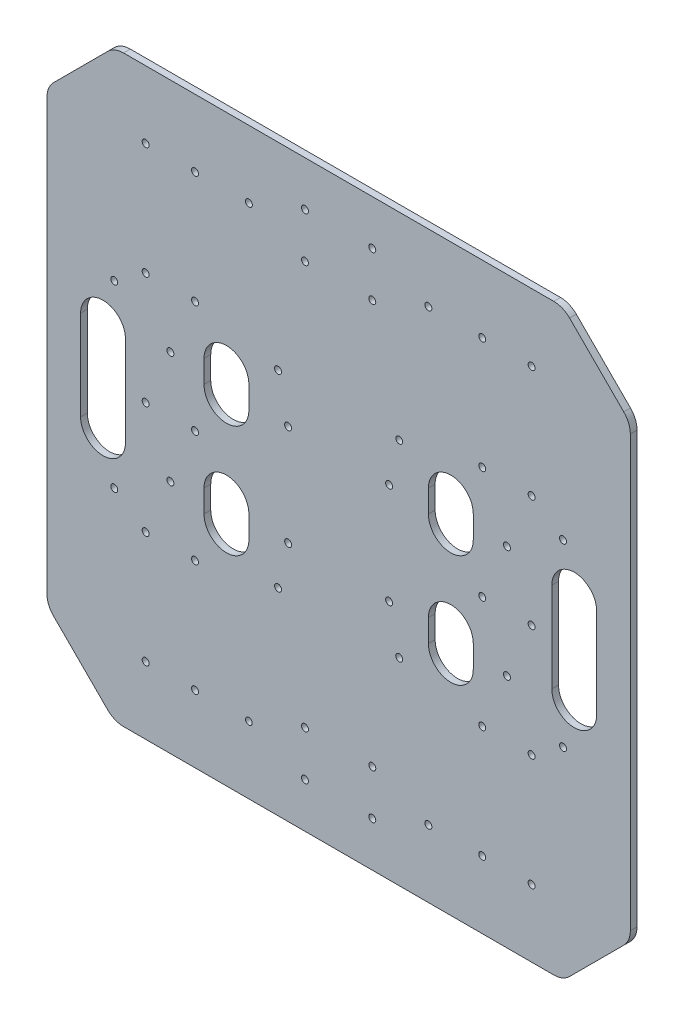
from build123d import *

# Parameters (mm, degrees)
EXTRUDE_1_DEPTH        = 3
SKETCH_3_R             = 1.55
SKETCH_3_R_2           = 1.5
CUT_EXTRUDE_2553_DEPTH = 184.872238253
SKETCH_5_R             = 1.55
SKETCH_5_R_2           = 1.5
CUT_EXTRUDE_3569_DEPTH = 184.872238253
SKETCH_6_R             = 1.55
CUT_EXTRUDE_4698_DEPTH = 184.872238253
CUT_EXTRUDE_5934_DEPTH = 184.872238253
FILLET_1_R             = 10


with BuildPart() as part:
    # Sketch 1 → Extrude 1 (new body)
    with BuildSketch(Plane.XY):
        Polygon((-130, 100), (-100, 130), (100, 130), (130, 100), (130, -100), (100, -130), (-100, -130), (-130, -100), align=None)
    extrude(amount=EXTRUDE_1_DEPTH)

    # Sketch 3 → Cut-Extrude 2553 (cut, through all)
    with BuildSketch(Plane.XY.offset(3)):
        with Locations((-86, 100)):
            Circle(SKETCH_3_R)
        with Locations((-64, 100)):
            Circle(SKETCH_3_R)
        with Locations((64, 100)):
            Circle(SKETCH_3_R)
        with Locations((86, 100)):
            Circle(SKETCH_3_R)
        with Locations((-86, -100)):
            Circle(SKETCH_3_R)
        with Locations((-64, -100)):
            Circle(SKETCH_3_R)
        with Locations((64, -100)):
            Circle(SKETCH_3_R)
        with Locations((86, -100)):
            Circle(SKETCH_3_R)
        with Locations((-40, 100)):
            Circle(SKETCH_3_R)
        with Locations((40, 100)):
            Circle(SKETCH_3_R)
        with Locations((100, 40)):
            Circle(SKETCH_3_R)
        with Locations((100, -40)):
            Circle(SKETCH_3_R)
        with Locations((40, -100)):
            Circle(SKETCH_3_R)
        with Locations((-40, -100)):
            Circle(SKETCH_3_R_2)
        with Locations((-100, -40)):
            Circle(SKETCH_3_R)
        with Locations((-100, 40)):
            Circle(SKETCH_3_R)
        with Locations((-86, 50)):
            Circle(SKETCH_3_R)
        with Locations((-64, 50)):
            Circle(SKETCH_3_R)
        with Locations((-86, -50)):
            Circle(SKETCH_3_R)
        with Locations((-64, -50)):
            Circle(SKETCH_3_R)
        with Locations((-86, 0)):
            Circle(SKETCH_3_R)
        with Locations((-64, 0)):
            Circle(SKETCH_3_R)
        with Locations((64, 50)):
            Circle(SKETCH_3_R)
        with Locations((86, 50)):
            Circle(SKETCH_3_R)
        with Locations((64, 0)):
            Circle(SKETCH_3_R)
        with Locations((86, 0)):
            Circle(SKETCH_3_R)
        with Locations((64, -50)):
            Circle(SKETCH_3_R)
        with Locations((86, -50)):
            Circle(SKETCH_3_R)
        with Locations((-75, 25)):
            Circle(SKETCH_3_R)
        with Locations((-75, -25)):
            Circle(SKETCH_3_R)
        with Locations((75, -25)):
            Circle(SKETCH_3_R)
        with Locations((75, 25)):
            Circle(SKETCH_3_R)
    extrude(amount=-CUT_EXTRUDE_2553_DEPTH, mode=Mode.SUBTRACT)

    # Sketch 5 → Cut-Extrude 3569 (cut, through all)
    with BuildSketch(Plane.XY.offset(3)):
        with Locations((-27, 42)):
            Circle(SKETCH_5_R)
        with Locations((-22.5, 22.5)):
            Circle(SKETCH_5_R)
        with Locations((27, 42)):
            Circle(SKETCH_5_R_2)
        with Locations((22.5, 22.5)):
            Circle(SKETCH_5_R)
        with Locations((-22.5, -22.5)):
            Circle(SKETCH_5_R)
        with Locations((22.5, -22.5)):
            Circle(SKETCH_5_R)
        with Locations((27, -42)):
            Circle(SKETCH_5_R)
        with Locations((-27, -42)):
            Circle(SKETCH_5_R)
    extrude(amount=-CUT_EXTRUDE_3569_DEPTH, mode=Mode.SUBTRACT)

    # Sketch 6 → Cut-Extrude 4698 (cut, through all)
    with BuildSketch(Plane.XY.offset(3)):
        with Locations((-15, 110)):
            Circle(SKETCH_6_R)
        with Locations((15, 110)):
            Circle(SKETCH_6_R)
        with Locations((-15, 90)):
            Circle(SKETCH_6_R)
        with Locations((15, 90)):
            Circle(SKETCH_6_R)
        with Locations((-15, -90)):
            Circle(SKETCH_6_R)
        with Locations((15, -90)):
            Circle(SKETCH_6_R)
        with Locations((-15, -110)):
            Circle(SKETCH_6_R)
        with Locations((15, -110)):
            Circle(SKETCH_6_R)
    extrude(amount=-CUT_EXTRUDE_4698_DEPTH, mode=Mode.SUBTRACT)

    # Sketch 8 → Cut-Extrude 5934 (cut, through all)
    with BuildSketch(Plane.XY.offset(3)):
        with BuildLine():
            Line((-60, 30), (-60, 20))
            ThreePointArc((-60, 20), (-50, 10), (-40, 20))
            Line((-40, 20), (-40, 30))
            ThreePointArc((-40, 30), (-50, 40), (-60, 30))
        make_face()
        with BuildLine():
            Line((40, 30), (40, 20))
            ThreePointArc((40, 20), (50, 10), (60, 20))
            Line((60, 20), (60, 30))
            ThreePointArc((60, 30), (50, 40), (40, 30))
        make_face()
        with BuildLine():
            Line((40, -20), (40, -30))
            ThreePointArc((40, -30), (50, -40), (60, -30))
            Line((60, -30), (60, -20))
            ThreePointArc((60, -20), (50, -10), (40, -20))
        make_face()
        with BuildLine():
            Line((-60, -20), (-60, -30))
            ThreePointArc((-60, -30), (-50, -40), (-40, -30))
            Line((-40, -30), (-40, -20))
            ThreePointArc((-40, -20), (-50, -10), (-60, -20))
        make_face()
        with BuildLine():
            Line((-95, -20), (-95, 20))
            ThreePointArc((-95, 20), (-105, 30), (-115, 20))
            Line((-115, 20), (-115, -20))
            ThreePointArc((-115, -20), (-105, -30), (-95, -20))
        make_face()
        with BuildLine():
            ThreePointArc((115, 20), (105, 30), (95, 20))
            Line((95, 20), (95, -20))
            ThreePointArc((95, -20), (105, -30), (115, -20))
            Line((115, -20), (115, 20))
        make_face()
    extrude(amount=-CUT_EXTRUDE_5934_DEPTH, mode=Mode.SUBTRACT)

    # Fillet 1
    fillet_1_edges = [part.edges().sort_by_distance(p)[0] for p in [
        (-130, 100, 1.5),
        (-100, 130, 1.5),
        (100, 130, 1.5),
        (130, 100, 1.5),
        (130, -100, 1.5),
        (100, -130, 1.5),
        (-100, -130, 1.5),
        (-130, -100, 1.5),
    ]]
    fillet(fillet_1_edges, radius=FILLET_1_R)


solid = part.part
